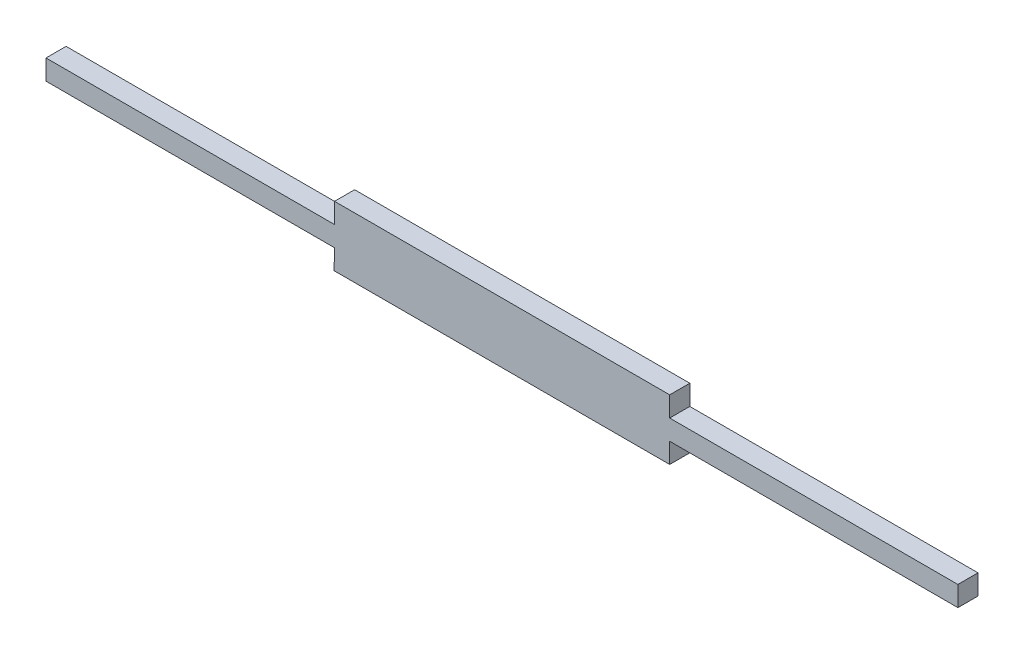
ISO-10303-21;
HEADER;
FILE_DESCRIPTION(('STEP AP214'),'2;1');
FILE_NAME('part.step','',(''),(''),'','','');
FILE_SCHEMA(('AUTOMOTIVE_DESIGN { 1 0 10303 214 1 1 1 1 }'));
ENDSEC;
DATA;
#1=APPLICATION_CONTEXT('core data for automotive mechanical design processes');
#2=APPLICATION_PROTOCOL_DEFINITION('international standard','automotive_design',2000,#1);
#3=PRODUCT_CONTEXT('',#1,'mechanical');
#4=PRODUCT('Part','Part','',(#3));
#5=PRODUCT_RELATED_PRODUCT_CATEGORY('part','',(#4));
#6=PRODUCT_DEFINITION_FORMATION('','',#4);
#7=PRODUCT_DEFINITION_CONTEXT('part definition',#1,'design');
#8=PRODUCT_DEFINITION('design','',#6,#7);
#9=PRODUCT_DEFINITION_SHAPE('','',#8);
#10=(LENGTH_UNIT() NAMED_UNIT(*) SI_UNIT(.MILLI.,.METRE.));
#11=(NAMED_UNIT(*) PLANE_ANGLE_UNIT() SI_UNIT($,.RADIAN.));
#12=(NAMED_UNIT(*) SI_UNIT($,.STERADIAN.) SOLID_ANGLE_UNIT());
#13=UNCERTAINTY_MEASURE_WITH_UNIT(LENGTH_MEASURE(1.E-05),#10,'distance_accuracy_value','');
#14=(GEOMETRIC_REPRESENTATION_CONTEXT(3) GLOBAL_UNCERTAINTY_ASSIGNED_CONTEXT((#13)) GLOBAL_UNIT_ASSIGNED_CONTEXT((#10,
#11,#12)) REPRESENTATION_CONTEXT('',''));
#15=CARTESIAN_POINT('',(0.,0.,0.));
#16=DIRECTION('',(0.,0.,1.));
#17=DIRECTION('',(1.,0.,0.));
#18=AXIS2_PLACEMENT_3D('',#15,#16,#17);
#19=CARTESIAN_POINT('',(22.1608305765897,4.11682272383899,1.524));
#20=DIRECTION('',(0.99977502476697,-0.0212108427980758,0.));
#21=DIRECTION('',(0.0212108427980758,0.99977502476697,0.));
#22=AXIS2_PLACEMENT_3D('',#19,#20,#21);
#23=PLANE('',#22);
#24=DIRECTION('',(-0.0212108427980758,-0.99977502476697,0.));
#25=VECTOR('',#24,1.);
#26=CARTESIAN_POINT('',(22.1608305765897,4.11682272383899,0.));
#27=LINE('',#26,#25);
#28=CARTESIAN_POINT('',(22.1608305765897,4.11682272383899,0.));
#29=VERTEX_POINT('',#28);
#30=CARTESIAN_POINT('',(22.1284979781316,2.59282272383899,0.));
#31=VERTEX_POINT('',#30);
#32=EDGE_CURVE('E154',#29,#31,#27,.T.);
#33=ORIENTED_EDGE('',*,*,#32,.T.);
#34=DIRECTION('',(0.,0.,-1.));
#35=VECTOR('',#34,1.);
#36=CARTESIAN_POINT('',(22.1284979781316,2.59282272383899,1.524));
#37=LINE('',#36,#35);
#38=CARTESIAN_POINT('',(22.1284979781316,2.59282272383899,1.524));
#39=VERTEX_POINT('',#38);
#40=EDGE_CURVE('E11',#39,#31,#37,.T.);
#41=ORIENTED_EDGE('',*,*,#40,.F.);
#42=DIRECTION('',(-0.0212108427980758,-0.99977502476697,0.));
#43=VECTOR('',#42,1.);
#44=CARTESIAN_POINT('',(22.1608305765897,4.11682272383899,1.524));
#45=LINE('',#44,#43);
#46=CARTESIAN_POINT('',(22.1608305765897,4.11682272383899,1.524));
#47=VERTEX_POINT('',#46);
#48=EDGE_CURVE('E176',#47,#39,#45,.T.);
#49=ORIENTED_EDGE('',*,*,#48,.F.);
#50=DIRECTION('',(0.,0.,-1.));
#51=VECTOR('',#50,1.);
#52=CARTESIAN_POINT('',(22.1608305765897,4.11682272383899,1.524));
#53=LINE('',#52,#51);
#54=EDGE_CURVE('E150',#47,#29,#53,.T.);
#55=ORIENTED_EDGE('',*,*,#54,.T.);
#56=EDGE_LOOP('',(#33,#41,#49,#55));
#57=FACE_BOUND('',#56,.T.);
#58=ADVANCED_FACE('F34',(#57),#23,.F.);
#59=CARTESIAN_POINT('',(22.1284979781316,2.59282272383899,1.524));
#60=DIRECTION('',(0.,1.,0.));
#61=DIRECTION('',(-1.,0.,0.));
#62=AXIS2_PLACEMENT_3D('',#59,#60,#61);
#63=PLANE('',#62);
#64=DIRECTION('',(1.,0.,0.));
#65=VECTOR('',#64,1.);
#66=CARTESIAN_POINT('',(22.1284979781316,2.59282272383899,0.));
#67=LINE('',#66,#65);
#68=CARTESIAN_POINT('',(47.5608305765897,2.59282272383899,0.));
#69=VERTEX_POINT('',#68);
#70=EDGE_CURVE('E157',#31,#69,#67,.T.);
#71=ORIENTED_EDGE('',*,*,#70,.T.);
#72=DIRECTION('',(0.,0.,-1.));
#73=VECTOR('',#72,1.);
#74=CARTESIAN_POINT('',(47.5608305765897,2.59282272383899,1.524));
#75=LINE('',#74,#73);
#76=CARTESIAN_POINT('',(47.5608305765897,2.59282272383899,1.524));
#77=VERTEX_POINT('',#76);
#78=EDGE_CURVE('E42',#77,#69,#75,.T.);
#79=ORIENTED_EDGE('',*,*,#78,.F.);
#80=DIRECTION('',(1.,0.,0.));
#81=VECTOR('',#80,1.);
#82=CARTESIAN_POINT('',(22.1284979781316,2.59282272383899,1.524));
#83=LINE('',#82,#81);
#84=EDGE_CURVE('E105',#39,#77,#83,.T.);
#85=ORIENTED_EDGE('',*,*,#84,.F.);
#86=ORIENTED_EDGE('',*,*,#40,.T.);
#87=EDGE_LOOP('',(#71,#79,#85,#86));
#88=FACE_BOUND('',#87,.T.);
#89=ADVANCED_FACE('F254',(#88),#63,.F.);
#90=CARTESIAN_POINT('',(47.5608305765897,2.59282272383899,1.524));
#91=DIRECTION('',(-1.,0.,0.));
#92=DIRECTION('',(0.,0.,1.));
#93=AXIS2_PLACEMENT_3D('',#90,#91,#92);
#94=PLANE('',#93);
#95=DIRECTION('',(0.,1.,0.));
#96=VECTOR('',#95,1.);
#97=CARTESIAN_POINT('',(47.5608305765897,2.59282272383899,0.));
#98=LINE('',#97,#96);
#99=CARTESIAN_POINT('',(47.5608305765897,4.11682272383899,0.));
#100=VERTEX_POINT('',#99);
#101=EDGE_CURVE('E159',#69,#100,#98,.T.);
#102=ORIENTED_EDGE('',*,*,#101,.T.);
#103=DIRECTION('',(0.,0.,-1.));
#104=VECTOR('',#103,1.);
#105=CARTESIAN_POINT('',(47.5608305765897,4.11682272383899,1.524));
#106=LINE('',#105,#104);
#107=CARTESIAN_POINT('',(47.5608305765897,4.11682272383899,1.524));
#108=VERTEX_POINT('',#107);
#109=EDGE_CURVE('E195',#108,#100,#106,.T.);
#110=ORIENTED_EDGE('',*,*,#109,.F.);
#111=DIRECTION('',(0.,1.,0.));
#112=VECTOR('',#111,1.);
#113=CARTESIAN_POINT('',(47.5608305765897,2.59282272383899,1.524));
#114=LINE('',#113,#112);
#115=EDGE_CURVE('E203',#77,#108,#114,.T.);
#116=ORIENTED_EDGE('',*,*,#115,.F.);
#117=ORIENTED_EDGE('',*,*,#78,.T.);
#118=EDGE_LOOP('',(#102,#110,#116,#117));
#119=FACE_BOUND('',#118,.T.);
#120=ADVANCED_FACE('F201',(#119),#94,.F.);
#121=CARTESIAN_POINT('',(47.5608305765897,4.11682272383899,1.524));
#122=DIRECTION('',(0.,1.,0.));
#123=DIRECTION('',(-1.,0.,0.));
#124=AXIS2_PLACEMENT_3D('',#121,#122,#123);
#125=PLANE('',#124);
#126=DIRECTION('',(1.,0.,0.));
#127=VECTOR('',#126,1.);
#128=CARTESIAN_POINT('',(47.5608305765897,4.11682272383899,0.));
#129=LINE('',#128,#127);
#130=CARTESIAN_POINT('',(69.4004978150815,4.11682272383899,0.));
#131=VERTEX_POINT('',#130);
#132=EDGE_CURVE('E161',#100,#131,#129,.T.);
#133=ORIENTED_EDGE('',*,*,#132,.T.);
#134=DIRECTION('',(0.,0.,-1.));
#135=VECTOR('',#134,1.);
#136=CARTESIAN_POINT('',(69.4004978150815,4.11682272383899,1.524));
#137=LINE('',#136,#135);
#138=CARTESIAN_POINT('',(69.4004978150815,4.11682272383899,1.524));
#139=VERTEX_POINT('',#138);
#140=EDGE_CURVE('E192',#139,#131,#137,.T.);
#141=ORIENTED_EDGE('',*,*,#140,.F.);
#142=DIRECTION('',(1.,0.,0.));
#143=VECTOR('',#142,1.);
#144=CARTESIAN_POINT('',(47.5608305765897,4.11682272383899,1.524));
#145=LINE('',#144,#143);
#146=EDGE_CURVE('E221',#108,#139,#145,.T.);
#147=ORIENTED_EDGE('',*,*,#146,.F.);
#148=ORIENTED_EDGE('',*,*,#109,.T.);
#149=EDGE_LOOP('',(#133,#141,#147,#148));
#150=FACE_BOUND('',#149,.T.);
#151=ADVANCED_FACE('F212',(#150),#125,.F.);
#152=CARTESIAN_POINT('',(69.4004978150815,4.11682272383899,1.524));
#153=DIRECTION('',(-1.,0.,0.));
#154=DIRECTION('',(0.,0.,1.));
#155=AXIS2_PLACEMENT_3D('',#152,#153,#154);
#156=PLANE('',#155);
#157=DIRECTION('',(0.,1.,0.));
#158=VECTOR('',#157,1.);
#159=CARTESIAN_POINT('',(69.4004978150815,4.11682272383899,0.));
#160=LINE('',#159,#158);
#161=CARTESIAN_POINT('',(69.4004978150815,5.64082272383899,0.));
#162=VERTEX_POINT('',#161);
#163=EDGE_CURVE('E163',#131,#162,#160,.T.);
#164=ORIENTED_EDGE('',*,*,#163,.T.);
#165=DIRECTION('',(0.,0.,-1.));
#166=VECTOR('',#165,1.);
#167=CARTESIAN_POINT('',(69.4004978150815,5.64082272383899,1.524));
#168=LINE('',#167,#166);
#169=CARTESIAN_POINT('',(69.4004978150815,5.64082272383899,1.524));
#170=VERTEX_POINT('',#169);
#171=EDGE_CURVE('E189',#170,#162,#168,.T.);
#172=ORIENTED_EDGE('',*,*,#171,.F.);
#173=DIRECTION('',(0.,1.,0.));
#174=VECTOR('',#173,1.);
#175=CARTESIAN_POINT('',(69.4004978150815,4.11682272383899,1.524));
#176=LINE('',#175,#174);
#177=EDGE_CURVE('E218',#139,#170,#176,.T.);
#178=ORIENTED_EDGE('',*,*,#177,.F.);
#179=ORIENTED_EDGE('',*,*,#140,.T.);
#180=EDGE_LOOP('',(#164,#172,#178,#179));
#181=FACE_BOUND('',#180,.T.);
#182=ADVANCED_FACE('F216',(#181),#156,.F.);
#183=CARTESIAN_POINT('',(69.4004978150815,5.64082272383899,1.524));
#184=DIRECTION('',(0.,-1.,0.));
#185=DIRECTION('',(1.,0.,0.));
#186=AXIS2_PLACEMENT_3D('',#183,#184,#185);
#187=PLANE('',#186);
#188=DIRECTION('',(-1.,0.,0.));
#189=VECTOR('',#188,1.);
#190=CARTESIAN_POINT('',(69.4004978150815,5.64082272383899,0.));
#191=LINE('',#190,#189);
#192=CARTESIAN_POINT('',(47.5608305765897,5.64082272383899,0.));
#193=VERTEX_POINT('',#192);
#194=EDGE_CURVE('E165',#162,#193,#191,.T.);
#195=ORIENTED_EDGE('',*,*,#194,.T.);
#196=DIRECTION('',(0.,0.,-1.));
#197=VECTOR('',#196,1.);
#198=CARTESIAN_POINT('',(47.5608305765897,5.64082272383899,1.524));
#199=LINE('',#198,#197);
#200=CARTESIAN_POINT('',(47.5608305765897,5.64082272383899,1.524));
#201=VERTEX_POINT('',#200);
#202=EDGE_CURVE('E186',#201,#193,#199,.T.);
#203=ORIENTED_EDGE('',*,*,#202,.F.);
#204=DIRECTION('',(-1.,0.,0.));
#205=VECTOR('',#204,1.);
#206=CARTESIAN_POINT('',(69.4004978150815,5.64082272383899,1.524));
#207=LINE('',#206,#205);
#208=EDGE_CURVE('E220',#170,#201,#207,.T.);
#209=ORIENTED_EDGE('',*,*,#208,.F.);
#210=ORIENTED_EDGE('',*,*,#171,.T.);
#211=EDGE_LOOP('',(#195,#203,#209,#210));
#212=FACE_BOUND('',#211,.T.);
#213=ADVANCED_FACE('F267',(#212),#187,.F.);
#214=CARTESIAN_POINT('',(47.5608305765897,5.64082272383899,1.524));
#215=DIRECTION('',(-1.,0.,0.));
#216=DIRECTION('',(0.,0.,1.));
#217=AXIS2_PLACEMENT_3D('',#214,#215,#216);
#218=PLANE('',#217);
#219=DIRECTION('',(0.,1.,0.));
#220=VECTOR('',#219,1.);
#221=CARTESIAN_POINT('',(47.5608305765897,5.64082272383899,0.));
#222=LINE('',#221,#220);
#223=CARTESIAN_POINT('',(47.5608305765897,7.16482272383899,0.));
#224=VERTEX_POINT('',#223);
#225=EDGE_CURVE('E167',#193,#224,#222,.T.);
#226=ORIENTED_EDGE('',*,*,#225,.T.);
#227=DIRECTION('',(0.,0.,-1.));
#228=VECTOR('',#227,1.);
#229=CARTESIAN_POINT('',(47.5608305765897,7.16482272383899,1.524));
#230=LINE('',#229,#228);
#231=CARTESIAN_POINT('',(47.5608305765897,7.16482272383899,1.524));
#232=VERTEX_POINT('',#231);
#233=EDGE_CURVE('E183',#232,#224,#230,.T.);
#234=ORIENTED_EDGE('',*,*,#233,.F.);
#235=DIRECTION('',(0.,1.,0.));
#236=VECTOR('',#235,1.);
#237=CARTESIAN_POINT('',(47.5608305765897,5.64082272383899,1.524));
#238=LINE('',#237,#236);
#239=EDGE_CURVE('E223',#201,#232,#238,.T.);
#240=ORIENTED_EDGE('',*,*,#239,.F.);
#241=ORIENTED_EDGE('',*,*,#202,.T.);
#242=EDGE_LOOP('',(#226,#234,#240,#241));
#243=FACE_BOUND('',#242,.T.);
#244=ADVANCED_FACE('F270',(#243),#218,.F.);
#245=CARTESIAN_POINT('',(47.5608305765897,7.16482272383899,1.524));
#246=DIRECTION('',(0.,-1.,0.));
#247=DIRECTION('',(1.,0.,0.));
#248=AXIS2_PLACEMENT_3D('',#245,#246,#247);
#249=PLANE('',#248);
#250=DIRECTION('',(-1.,0.,0.));
#251=VECTOR('',#250,1.);
#252=CARTESIAN_POINT('',(47.5608305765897,7.16482272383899,0.));
#253=LINE('',#252,#251);
#254=CARTESIAN_POINT('',(22.1608305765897,7.16482272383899,0.));
#255=VERTEX_POINT('',#254);
#256=EDGE_CURVE('E169',#224,#255,#253,.T.);
#257=ORIENTED_EDGE('',*,*,#256,.T.);
#258=DIRECTION('',(0.,0.,-1.));
#259=VECTOR('',#258,1.);
#260=CARTESIAN_POINT('',(22.1608305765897,7.16482272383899,1.524));
#261=LINE('',#260,#259);
#262=CARTESIAN_POINT('',(22.1608305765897,7.16482272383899,1.524));
#263=VERTEX_POINT('',#262);
#264=EDGE_CURVE('E180',#263,#255,#261,.T.);
#265=ORIENTED_EDGE('',*,*,#264,.F.);
#266=DIRECTION('',(-1.,0.,0.));
#267=VECTOR('',#266,1.);
#268=CARTESIAN_POINT('',(47.5608305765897,7.16482272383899,1.524));
#269=LINE('',#268,#267);
#270=EDGE_CURVE('E229',#232,#263,#269,.T.);
#271=ORIENTED_EDGE('',*,*,#270,.F.);
#272=ORIENTED_EDGE('',*,*,#233,.T.);
#273=EDGE_LOOP('',(#257,#265,#271,#272));
#274=FACE_BOUND('',#273,.T.);
#275=ADVANCED_FACE('F235',(#274),#249,.F.);
#276=CARTESIAN_POINT('',(22.1608305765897,7.16482272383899,1.524));
#277=DIRECTION('',(1.,0.,0.));
#278=DIRECTION('',(0.,1.,0.));
#279=AXIS2_PLACEMENT_3D('',#276,#277,#278);
#280=PLANE('',#279);
#281=DIRECTION('',(0.,-1.,0.));
#282=VECTOR('',#281,1.);
#283=CARTESIAN_POINT('',(22.1608305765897,7.16482272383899,0.));
#284=LINE('',#283,#282);
#285=CARTESIAN_POINT('',(22.1608305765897,5.64082272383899,0.));
#286=VERTEX_POINT('',#285);
#287=EDGE_CURVE('E171',#255,#286,#284,.T.);
#288=ORIENTED_EDGE('',*,*,#287,.T.);
#289=DIRECTION('',(0.,0.,-1.));
#290=VECTOR('',#289,1.);
#291=CARTESIAN_POINT('',(22.1608305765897,5.64082272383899,1.524));
#292=LINE('',#291,#290);
#293=CARTESIAN_POINT('',(22.1608305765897,5.64082272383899,1.524));
#294=VERTEX_POINT('',#293);
#295=EDGE_CURVE('E145',#294,#286,#292,.T.);
#296=ORIENTED_EDGE('',*,*,#295,.F.);
#297=DIRECTION('',(0.,-1.,0.));
#298=VECTOR('',#297,1.);
#299=CARTESIAN_POINT('',(22.1608305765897,7.16482272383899,1.524));
#300=LINE('',#299,#298);
#301=EDGE_CURVE('E136',#263,#294,#300,.T.);
#302=ORIENTED_EDGE('',*,*,#301,.F.);
#303=ORIENTED_EDGE('',*,*,#264,.T.);
#304=EDGE_LOOP('',(#288,#296,#302,#303));
#305=FACE_BOUND('',#304,.T.);
#306=ADVANCED_FACE('F239',(#305),#280,.F.);
#307=CARTESIAN_POINT('',(22.1608305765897,5.64082272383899,1.524));
#308=DIRECTION('',(0.,-1.,0.));
#309=DIRECTION('',(1.,0.,0.));
#310=AXIS2_PLACEMENT_3D('',#307,#308,#309);
#311=PLANE('',#310);
#312=DIRECTION('',(-1.,0.,0.));
#313=VECTOR('',#312,1.);
#314=CARTESIAN_POINT('',(22.1608305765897,5.64082272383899,0.));
#315=LINE('',#314,#313);
#316=CARTESIAN_POINT('',(0.29725288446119,5.64082272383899,0.));
#317=VERTEX_POINT('',#316);
#318=EDGE_CURVE('E144',#286,#317,#315,.T.);
#319=ORIENTED_EDGE('',*,*,#318,.T.);
#320=DIRECTION('',(0.,0.,-1.));
#321=VECTOR('',#320,1.);
#322=CARTESIAN_POINT('',(0.29725288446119,5.64082272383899,1.524));
#323=LINE('',#322,#321);
#324=CARTESIAN_POINT('',(0.29725288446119,5.64082272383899,1.524));
#325=VERTEX_POINT('',#324);
#326=EDGE_CURVE('E141',#325,#317,#323,.T.);
#327=ORIENTED_EDGE('',*,*,#326,.F.);
#328=DIRECTION('',(-1.,0.,0.));
#329=VECTOR('',#328,1.);
#330=CARTESIAN_POINT('',(22.1608305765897,5.64082272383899,1.524));
#331=LINE('',#330,#329);
#332=EDGE_CURVE('E130',#294,#325,#331,.T.);
#333=ORIENTED_EDGE('',*,*,#332,.F.);
#334=ORIENTED_EDGE('',*,*,#295,.T.);
#335=EDGE_LOOP('',(#319,#327,#333,#334));
#336=FACE_BOUND('',#335,.T.);
#337=ADVANCED_FACE('F142',(#336),#311,.F.);
#338=CARTESIAN_POINT('',(0.297252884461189,4.11682272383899,1.524));
#339=DIRECTION('',(1.,0.,0.));
#340=DIRECTION('',(0.,1.,0.));
#341=AXIS2_PLACEMENT_3D('',#338,#339,#340);
#342=PLANE('',#341);
#343=DIRECTION('',(0.,-1.,0.));
#344=VECTOR('',#343,1.);
#345=CARTESIAN_POINT('',(0.297252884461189,4.11682272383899,0.));
#346=LINE('',#345,#344);
#347=CARTESIAN_POINT('',(0.297252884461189,4.11682272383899,0.));
#348=VERTEX_POINT('',#347);
#349=EDGE_CURVE('E91',#317,#348,#346,.T.);
#350=ORIENTED_EDGE('',*,*,#349,.T.);
#351=DIRECTION('',(0.,0.,-1.));
#352=VECTOR('',#351,1.);
#353=CARTESIAN_POINT('',(0.297252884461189,4.11682272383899,1.524));
#354=LINE('',#353,#352);
#355=CARTESIAN_POINT('',(0.297252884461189,4.11682272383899,1.524));
#356=VERTEX_POINT('',#355);
#357=EDGE_CURVE('E146',#356,#348,#354,.T.);
#358=ORIENTED_EDGE('',*,*,#357,.F.);
#359=DIRECTION('',(0.,-1.,0.));
#360=VECTOR('',#359,1.);
#361=CARTESIAN_POINT('',(0.297252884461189,4.11682272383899,1.524));
#362=LINE('',#361,#360);
#363=EDGE_CURVE('E134',#325,#356,#362,.T.);
#364=ORIENTED_EDGE('',*,*,#363,.F.);
#365=ORIENTED_EDGE('',*,*,#326,.T.);
#366=EDGE_LOOP('',(#350,#358,#364,#365));
#367=FACE_BOUND('',#366,.T.);
#368=ADVANCED_FACE('F148',(#367),#342,.F.);
#369=CARTESIAN_POINT('',(0.297252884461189,4.11682272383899,1.524));
#370=DIRECTION('',(0.,1.,0.));
#371=DIRECTION('',(0.,0.,1.));
#372=AXIS2_PLACEMENT_3D('',#369,#370,#371);
#373=PLANE('',#372);
#374=DIRECTION('',(1.,0.,0.));
#375=VECTOR('',#374,1.);
#376=CARTESIAN_POINT('',(0.297252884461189,4.11682272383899,0.));
#377=LINE('',#376,#375);
#378=EDGE_CURVE('E97',#348,#29,#377,.T.);
#379=ORIENTED_EDGE('',*,*,#378,.T.);
#380=ORIENTED_EDGE('',*,*,#54,.F.);
#381=DIRECTION('',(1.,0.,0.));
#382=VECTOR('',#381,1.);
#383=CARTESIAN_POINT('',(0.297252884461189,4.11682272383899,1.524));
#384=LINE('',#383,#382);
#385=EDGE_CURVE('E50',#356,#47,#384,.T.);
#386=ORIENTED_EDGE('',*,*,#385,.F.);
#387=ORIENTED_EDGE('',*,*,#357,.T.);
#388=EDGE_LOOP('',(#379,#380,#386,#387));
#389=FACE_BOUND('',#388,.T.);
#390=ADVANCED_FACE('F243',(#389),#373,.F.);
#391=CARTESIAN_POINT('',(0.,0.,1.524));
#392=DIRECTION('',(0.,0.,1.));
#393=DIRECTION('',(1.,0.,0.));
#394=AXIS2_PLACEMENT_3D('',#391,#392,#393);
#395=PLANE('',#394);
#396=ORIENTED_EDGE('',*,*,#48,.T.);
#397=ORIENTED_EDGE('',*,*,#84,.T.);
#398=ORIENTED_EDGE('',*,*,#115,.T.);
#399=ORIENTED_EDGE('',*,*,#146,.T.);
#400=ORIENTED_EDGE('',*,*,#177,.T.);
#401=ORIENTED_EDGE('',*,*,#208,.T.);
#402=ORIENTED_EDGE('',*,*,#239,.T.);
#403=ORIENTED_EDGE('',*,*,#270,.T.);
#404=ORIENTED_EDGE('',*,*,#301,.T.);
#405=ORIENTED_EDGE('',*,*,#332,.T.);
#406=ORIENTED_EDGE('',*,*,#363,.T.);
#407=ORIENTED_EDGE('',*,*,#385,.T.);
#408=EDGE_LOOP('',(#396,#397,#398,#399,#400,#401,#402,#403,#404,#405,#406,#407));
#409=FACE_BOUND('',#408,.T.);
#410=ADVANCED_FACE('F132',(#409),#395,.T.);
#411=CARTESIAN_POINT('',(0.,0.,0.));
#412=DIRECTION('',(0.,0.,1.));
#413=DIRECTION('',(1.,0.,0.));
#414=AXIS2_PLACEMENT_3D('',#411,#412,#413);
#415=PLANE('',#414);
#416=ORIENTED_EDGE('',*,*,#32,.F.);
#417=ORIENTED_EDGE('',*,*,#378,.F.);
#418=ORIENTED_EDGE('',*,*,#349,.F.);
#419=ORIENTED_EDGE('',*,*,#318,.F.);
#420=ORIENTED_EDGE('',*,*,#287,.F.);
#421=ORIENTED_EDGE('',*,*,#256,.F.);
#422=ORIENTED_EDGE('',*,*,#225,.F.);
#423=ORIENTED_EDGE('',*,*,#194,.F.);
#424=ORIENTED_EDGE('',*,*,#163,.F.);
#425=ORIENTED_EDGE('',*,*,#132,.F.);
#426=ORIENTED_EDGE('',*,*,#101,.F.);
#427=ORIENTED_EDGE('',*,*,#70,.F.);
#428=EDGE_LOOP('',(#416,#417,#418,#419,#420,#421,#422,#423,#424,#425,#426,#427));
#429=FACE_BOUND('',#428,.T.);
#430=ADVANCED_FACE('F207',(#429),#415,.F.);
#431=CLOSED_SHELL('',(#58,#89,#120,#151,#182,#213,#244,#275,#306,#337,#368,#390,#410,#430));
#432=MANIFOLD_SOLID_BREP('B2',#431);
#433=ADVANCED_BREP_SHAPE_REPRESENTATION('',(#18,#432),#14);
#434=SHAPE_DEFINITION_REPRESENTATION(#9,#433);
ENDSEC;
END-ISO-10303-21;
